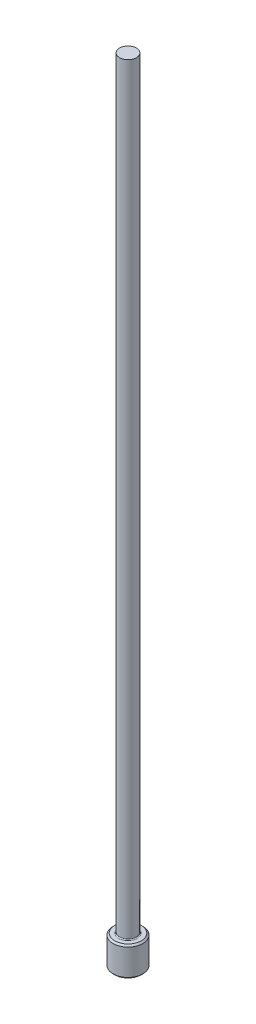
ISO-10303-21;
HEADER;
FILE_DESCRIPTION(('STEP AP214'),'2;1');
FILE_NAME('part.step','',(''),(''),'','','');
FILE_SCHEMA(('AUTOMOTIVE_DESIGN { 1 0 10303 214 1 1 1 1 }'));
ENDSEC;
DATA;
#1=APPLICATION_CONTEXT('core data for automotive mechanical design processes');
#2=APPLICATION_PROTOCOL_DEFINITION('international standard','automotive_design',2000,#1);
#3=PRODUCT_CONTEXT('',#1,'mechanical');
#4=PRODUCT('Part','Part','',(#3));
#5=PRODUCT_RELATED_PRODUCT_CATEGORY('part','',(#4));
#6=PRODUCT_DEFINITION_FORMATION('','',#4);
#7=PRODUCT_DEFINITION_CONTEXT('part definition',#1,'design');
#8=PRODUCT_DEFINITION('design','',#6,#7);
#9=PRODUCT_DEFINITION_SHAPE('','',#8);
#10=(LENGTH_UNIT() NAMED_UNIT(*) SI_UNIT(.MILLI.,.METRE.));
#11=(NAMED_UNIT(*) PLANE_ANGLE_UNIT() SI_UNIT($,.RADIAN.));
#12=(NAMED_UNIT(*) SI_UNIT($,.STERADIAN.) SOLID_ANGLE_UNIT());
#13=UNCERTAINTY_MEASURE_WITH_UNIT(LENGTH_MEASURE(1.E-05),#10,'distance_accuracy_value','');
#14=(GEOMETRIC_REPRESENTATION_CONTEXT(3) GLOBAL_UNCERTAINTY_ASSIGNED_CONTEXT((#13)) GLOBAL_UNIT_ASSIGNED_CONTEXT((#10,
#11,#12)) REPRESENTATION_CONTEXT('',''));
#15=CARTESIAN_POINT('',(0.,0.,0.));
#16=DIRECTION('',(0.,0.,1.));
#17=DIRECTION('',(1.,0.,0.));
#18=AXIS2_PLACEMENT_3D('',#15,#16,#17);
#19=CARTESIAN_POINT('',(0.,0.,0.));
#20=DIRECTION('',(0.,-1.,0.));
#21=DIRECTION('',(0.,0.,-1.));
#22=AXIS2_PLACEMENT_3D('',#19,#20,#21);
#23=PLANE('',#22);
#24=CARTESIAN_POINT('',(0.,0.,0.));
#25=DIRECTION('',(0.,-1.,0.));
#26=DIRECTION('',(0.,0.,-1.));
#27=AXIS2_PLACEMENT_3D('',#24,#25,#26);
#28=CIRCLE('',#27,1.06679999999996);
#29=CARTESIAN_POINT('',(0.,0.,-1.06679999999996));
#30=VERTEX_POINT('',#29);
#31=EDGE_CURVE('E46',#30,#30,#28,.T.);
#32=ORIENTED_EDGE('',*,*,#31,.T.);
#33=EDGE_LOOP('',(#32));
#34=FACE_BOUND('',#33,.T.);
#35=ADVANCED_FACE('F35',(#34),#23,.T.);
#36=CARTESIAN_POINT('',(0.,259.958771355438,0.));
#37=DIRECTION('',(0.,1.,0.));
#38=DIRECTION('',(0.,0.,1.));
#39=AXIS2_PLACEMENT_3D('',#36,#37,#38);
#40=CYLINDRICAL_SURFACE('',#39,1.19379999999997);
#41=CARTESIAN_POINT('',(0.,2.23519999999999,0.));
#42=DIRECTION('',(0.,1.,0.));
#43=DIRECTION('',(0.,0.,1.));
#44=AXIS2_PLACEMENT_3D('',#41,#42,#43);
#45=CIRCLE('',#44,1.19379999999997);
#46=CARTESIAN_POINT('',(0.,2.23519999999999,1.19379999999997));
#47=VERTEX_POINT('',#46);
#48=EDGE_CURVE('E50',#47,#47,#45,.F.);
#49=ORIENTED_EDGE('',*,*,#48,.T.);
#50=EDGE_LOOP('',(#49));
#51=FACE_BOUND('',#50,.T.);
#52=CARTESIAN_POINT('',(0.,0.126999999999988,0.));
#53=DIRECTION('',(0.,-1.,0.));
#54=DIRECTION('',(0.,0.,-1.));
#55=AXIS2_PLACEMENT_3D('',#52,#53,#54);
#56=CIRCLE('',#55,1.19379999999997);
#57=CARTESIAN_POINT('',(0.,0.126999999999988,-1.19379999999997));
#58=VERTEX_POINT('',#57);
#59=EDGE_CURVE('E55',#58,#58,#56,.F.);
#60=ORIENTED_EDGE('',*,*,#59,.T.);
#61=EDGE_LOOP('',(#60));
#62=FACE_BOUND('',#61,.T.);
#63=ADVANCED_FACE('F77',(#51,#62),#40,.T.);
#64=CARTESIAN_POINT('',(-1.19379999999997,2.3622,0.));
#65=DIRECTION('',(0.,1.,0.));
#66=DIRECTION('',(0.,0.,1.));
#67=AXIS2_PLACEMENT_3D('',#64,#65,#66);
#68=PLANE('',#67);
#69=CARTESIAN_POINT('',(0.,2.3622,0.));
#70=DIRECTION('',(0.,1.,0.));
#71=DIRECTION('',(0.,0.,1.));
#72=AXIS2_PLACEMENT_3D('',#69,#70,#71);
#73=CIRCLE('',#72,0.749299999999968);
#74=CARTESIAN_POINT('',(0.,2.3622,0.749299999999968));
#75=VERTEX_POINT('',#74);
#76=EDGE_CURVE('E10',#75,#75,#73,.F.);
#77=ORIENTED_EDGE('',*,*,#76,.T.);
#78=EDGE_LOOP('',(#77));
#79=FACE_BOUND('',#78,.T.);
#80=CARTESIAN_POINT('',(0.,2.3622,0.));
#81=DIRECTION('',(0.,1.,0.));
#82=DIRECTION('',(0.,0.,1.));
#83=AXIS2_PLACEMENT_3D('',#80,#81,#82);
#84=CIRCLE('',#83,1.06679999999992);
#85=CARTESIAN_POINT('',(0.,2.3622,1.06679999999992));
#86=VERTEX_POINT('',#85);
#87=EDGE_CURVE('E58',#86,#86,#84,.T.);
#88=ORIENTED_EDGE('',*,*,#87,.T.);
#89=EDGE_LOOP('',(#88));
#90=FACE_BOUND('',#89,.T.);
#91=ADVANCED_FACE('F69',(#79,#90),#68,.T.);
#92=CARTESIAN_POINT('',(0.,259.958771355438,0.));
#93=DIRECTION('',(0.,1.,0.));
#94=DIRECTION('',(0.,0.,1.));
#95=AXIS2_PLACEMENT_3D('',#92,#93,#94);
#96=CYLINDRICAL_SURFACE('',#95,0.673099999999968);
#97=CARTESIAN_POINT('',(0.,2.43840000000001,0.));
#98=DIRECTION('',(0.,1.,0.));
#99=DIRECTION('',(0.,0.,1.));
#100=AXIS2_PLACEMENT_3D('',#97,#98,#99);
#101=CIRCLE('',#100,0.673099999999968);
#102=CARTESIAN_POINT('',(0.,2.43840000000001,0.673099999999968));
#103=VERTEX_POINT('',#102);
#104=EDGE_CURVE('E42',#103,#103,#101,.T.);
#105=ORIENTED_EDGE('',*,*,#104,.T.);
#106=EDGE_LOOP('',(#105));
#107=FACE_BOUND('',#106,.T.);
#108=CARTESIAN_POINT('',(0.,63.5,0.));
#109=DIRECTION('',(0.,1.,0.));
#110=DIRECTION('',(0.,0.,1.));
#111=AXIS2_PLACEMENT_3D('',#108,#109,#110);
#112=CIRCLE('',#111,0.673099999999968);
#113=CARTESIAN_POINT('',(0.,63.5,0.673099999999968));
#114=VERTEX_POINT('',#113);
#115=EDGE_CURVE('E61',#114,#114,#112,.T.);
#116=ORIENTED_EDGE('',*,*,#115,.F.);
#117=EDGE_LOOP('',(#116));
#118=FACE_BOUND('',#117,.T.);
#119=ADVANCED_FACE('F67',(#107,#118),#96,.T.);
#120=CARTESIAN_POINT('',(-0.673099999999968,63.5,0.));
#121=DIRECTION('',(0.,1.,0.));
#122=DIRECTION('',(0.,0.,1.));
#123=AXIS2_PLACEMENT_3D('',#120,#121,#122);
#124=PLANE('',#123);
#125=ORIENTED_EDGE('',*,*,#115,.T.);
#126=EDGE_LOOP('',(#125));
#127=FACE_BOUND('',#126,.T.);
#128=ADVANCED_FACE('F65',(#127),#124,.T.);
#129=CARTESIAN_POINT('',(0.,2.36219999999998,0.));
#130=DIRECTION('',(0.,-1.,0.));
#131=DIRECTION('',(0.,0.,-1.));
#132=AXIS2_PLACEMENT_3D('',#129,#130,#131);
#133=CONICAL_SURFACE('',#132,1.06679999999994,0.785398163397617);
#134=ORIENTED_EDGE('',*,*,#48,.F.);
#135=EDGE_LOOP('',(#134));
#136=FACE_BOUND('',#135,.T.);
#137=ORIENTED_EDGE('',*,*,#87,.F.);
#138=EDGE_LOOP('',(#137));
#139=FACE_BOUND('',#138,.T.);
#140=ADVANCED_FACE('F75',(#136,#139),#133,.T.);
#141=CARTESIAN_POINT('',(0.,0.126999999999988,0.));
#142=DIRECTION('',(0.,1.,0.));
#143=DIRECTION('',(0.,0.,1.));
#144=AXIS2_PLACEMENT_3D('',#141,#142,#143);
#145=CONICAL_SURFACE('',#144,1.19379999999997,0.785398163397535);
#146=ORIENTED_EDGE('',*,*,#31,.F.);
#147=EDGE_LOOP('',(#146));
#148=FACE_BOUND('',#147,.T.);
#149=ORIENTED_EDGE('',*,*,#59,.F.);
#150=EDGE_LOOP('',(#149));
#151=FACE_BOUND('',#150,.T.);
#152=ADVANCED_FACE('F89',(#148,#151),#145,.T.);
#153=CARTESIAN_POINT('',(0.,2.43840000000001,0.));
#154=DIRECTION('',(0.,1.,0.));
#155=DIRECTION('',(0.,0.,1.));
#156=AXIS2_PLACEMENT_3D('',#153,#154,#155);
#157=TOROIDAL_SURFACE('',#156,0.749299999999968,0.0762);
#158=ORIENTED_EDGE('',*,*,#76,.F.);
#159=EDGE_LOOP('',(#158));
#160=FACE_BOUND('',#159,.T.);
#161=ORIENTED_EDGE('',*,*,#104,.F.);
#162=EDGE_LOOP('',(#161));
#163=FACE_BOUND('',#162,.T.);
#164=ADVANCED_FACE('F37',(#160,#163),#157,.F.);
#165=CLOSED_SHELL('',(#35,#63,#91,#119,#128,#140,#152,#164));
#166=MANIFOLD_SOLID_BREP('B2',#165);
#167=ADVANCED_BREP_SHAPE_REPRESENTATION('',(#18,#166),#14);
#168=SHAPE_DEFINITION_REPRESENTATION(#9,#167);
ENDSEC;
END-ISO-10303-21;
